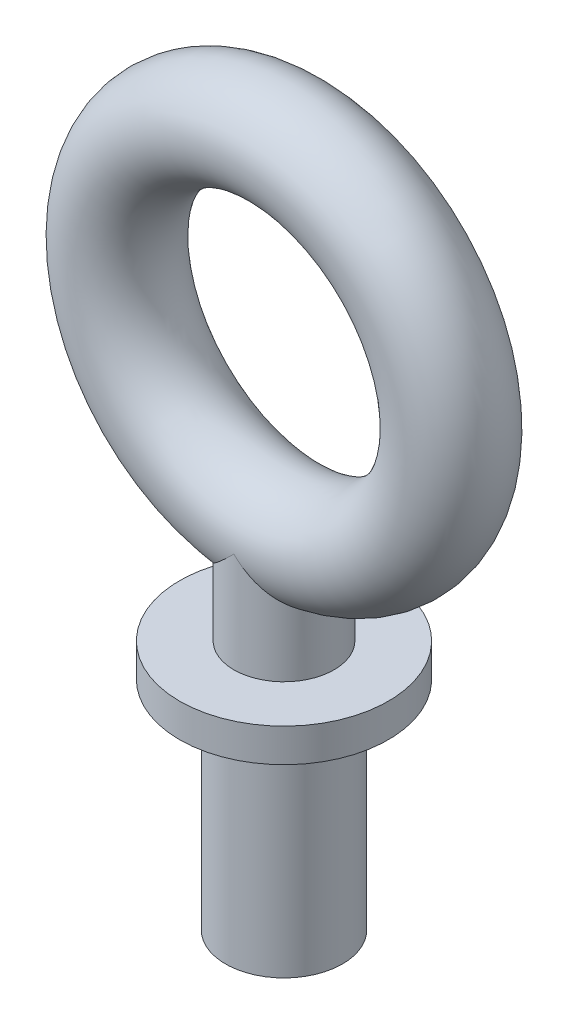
ISO-10303-21;
HEADER;
FILE_DESCRIPTION(('STEP AP214'),'2;1');
FILE_NAME('part.step','',(''),(''),'','','');
FILE_SCHEMA(('AUTOMOTIVE_DESIGN { 1 0 10303 214 1 1 1 1 }'));
ENDSEC;
DATA;
#1=APPLICATION_CONTEXT('core data for automotive mechanical design processes');
#2=APPLICATION_PROTOCOL_DEFINITION('international standard','automotive_design',2000,#1);
#3=PRODUCT_CONTEXT('',#1,'mechanical');
#4=PRODUCT('Part','Part','',(#3));
#5=PRODUCT_RELATED_PRODUCT_CATEGORY('part','',(#4));
#6=PRODUCT_DEFINITION_FORMATION('','',#4);
#7=PRODUCT_DEFINITION_CONTEXT('part definition',#1,'design');
#8=PRODUCT_DEFINITION('design','',#6,#7);
#9=PRODUCT_DEFINITION_SHAPE('','',#8);
#10=(LENGTH_UNIT() NAMED_UNIT(*) SI_UNIT(.MILLI.,.METRE.));
#11=(NAMED_UNIT(*) PLANE_ANGLE_UNIT() SI_UNIT($,.RADIAN.));
#12=(NAMED_UNIT(*) SI_UNIT($,.STERADIAN.) SOLID_ANGLE_UNIT());
#13=UNCERTAINTY_MEASURE_WITH_UNIT(LENGTH_MEASURE(1.E-05),#10,'distance_accuracy_value','');
#14=(GEOMETRIC_REPRESENTATION_CONTEXT(3) GLOBAL_UNCERTAINTY_ASSIGNED_CONTEXT((#13)) GLOBAL_UNIT_ASSIGNED_CONTEXT((#10,
#11,#12)) REPRESENTATION_CONTEXT('',''));
#15=CARTESIAN_POINT('',(0.,0.,0.));
#16=DIRECTION('',(0.,0.,1.));
#17=DIRECTION('',(1.,0.,0.));
#18=AXIS2_PLACEMENT_3D('',#15,#16,#17);
#19=CARTESIAN_POINT('',(0.,33.022,0.));
#20=DIRECTION('',(0.,-1.,0.));
#21=DIRECTION('',(0.,0.,-1.));
#22=AXIS2_PLACEMENT_3D('',#19,#20,#21);
#23=CYLINDRICAL_SURFACE('',#22,7.62);
#24=CARTESIAN_POINT('',(0.,-25.4,-7.62));
#25=CARTESIAN_POINT('',(0.00411493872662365,-25.4041149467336,-7.6200000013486));
#26=CARTESIAN_POINT('',(0.00823045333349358,-25.4082294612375,-7.6199966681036));
#27=CARTESIAN_POINT('',(0.46651280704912,-25.8662883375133,-7.6192539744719));
#28=CARTESIAN_POINT('',(0.927633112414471,-26.3149263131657,-7.57788714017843));
#29=CARTESIAN_POINT('',(1.62086951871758,-26.973112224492,-7.44933852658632));
#30=CARTESIAN_POINT('',(1.85250236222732,-27.190311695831,-7.39529502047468));
#31=CARTESIAN_POINT('',(2.31469432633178,-27.6186947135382,-7.26390249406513));
#32=CARTESIAN_POINT('',(2.54525367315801,-27.829879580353,-7.18655863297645));
#33=CARTESIAN_POINT('',(3.17743918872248,-28.4025850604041,-6.93941861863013));
#34=CARTESIAN_POINT('',(3.57622005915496,-28.7566801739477,-6.74398858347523));
#35=CARTESIAN_POINT('',(4.35136229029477,-29.4333736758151,-6.27181099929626));
#36=CARTESIAN_POINT('',(4.72775667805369,-29.7560189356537,-5.9951870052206));
#37=CARTESIAN_POINT('',(5.36625561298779,-30.2955884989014,-5.4231627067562));
#38=CARTESIAN_POINT('',(5.63579554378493,-30.5205083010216,-5.14380076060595));
#39=CARTESIAN_POINT('',(6.01270124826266,-30.8320624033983,-4.68519414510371));
#40=CARTESIAN_POINT('',(6.13376462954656,-30.9316058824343,-4.52573881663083));
#41=CARTESIAN_POINT('',(6.36526394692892,-31.1211241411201,-4.1938875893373));
#42=CARTESIAN_POINT('',(6.47570154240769,-31.2111004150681,-4.02149371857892));
#43=CARTESIAN_POINT('',(6.66713662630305,-31.3664718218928,-3.69372161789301));
#44=CARTESIAN_POINT('',(6.7499922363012,-31.4334784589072,-3.54018793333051));
#45=CARTESIAN_POINT('',(6.90608009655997,-31.5593540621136,-3.22511238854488));
#46=CARTESIAN_POINT('',(6.97931415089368,-31.6182245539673,-3.06357203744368));
#47=CARTESIAN_POINT('',(7.11516688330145,-31.7271720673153,-2.73325505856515));
#48=CARTESIAN_POINT('',(7.17778790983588,-31.7772510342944,-2.56448004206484));
#49=CARTESIAN_POINT('',(7.29150476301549,-31.8680169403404,-2.2206186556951));
#50=CARTESIAN_POINT('',(7.34260042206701,-31.9087037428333,-2.04553219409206));
#51=CARTESIAN_POINT('',(7.43267616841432,-31.9803258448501,-1.68927738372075));
#52=CARTESIAN_POINT('',(7.47159043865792,-32.0112081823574,-1.50808166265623));
#53=CARTESIAN_POINT('',(7.53625055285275,-32.062473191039,-1.141882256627));
#54=CARTESIAN_POINT('',(7.56199629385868,-32.0828557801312,-0.956878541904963));
#55=CARTESIAN_POINT('',(7.59983903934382,-32.1128019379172,-0.584662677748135));
#56=CARTESIAN_POINT('',(7.61194000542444,-32.122368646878,-0.397451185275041));
#57=CARTESIAN_POINT('',(7.62227520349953,-32.1305399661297,-0.0224142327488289));
#58=CARTESIAN_POINT('',(7.62051051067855,-32.1291454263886,0.165411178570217));
#59=CARTESIAN_POINT('',(7.60395034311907,-32.1160506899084,0.522836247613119));
#60=CARTESIAN_POINT('',(7.59036357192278,-32.1053064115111,0.692529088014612));
#61=CARTESIAN_POINT('',(7.55198907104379,-32.0749322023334,1.02989839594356));
#62=CARTESIAN_POINT('',(7.52719756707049,-32.0552992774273,1.19757416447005));
#63=CARTESIAN_POINT('',(7.46679991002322,-32.0074055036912,1.52962946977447));
#64=CARTESIAN_POINT('',(7.4311984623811,-31.9791484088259,1.69401040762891));
#65=CARTESIAN_POINT('',(7.34967696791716,-31.9143328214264,2.01857919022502));
#66=CARTESIAN_POINT('',(7.30375297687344,-31.877771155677,2.17876540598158));
#67=CARTESIAN_POINT('',(7.2015925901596,-31.7962668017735,2.49590611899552));
#68=CARTESIAN_POINT('',(7.14523735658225,-31.7512274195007,2.65279745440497));
#69=CARTESIAN_POINT('',(7.02331973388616,-31.6535468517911,2.96054290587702));
#70=CARTESIAN_POINT('',(6.95775407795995,-31.6009029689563,3.11139485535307));
#71=CARTESIAN_POINT('',(6.74840844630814,-31.4323363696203,3.5538227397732));
#72=CARTESIAN_POINT('',(6.59191338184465,-31.3057259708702,3.83547286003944));
#73=CARTESIAN_POINT('',(6.23052528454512,-31.0112063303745,4.4012884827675));
#74=CARTESIAN_POINT('',(6.02204158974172,-30.8401273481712,4.68146598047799));
#75=CARTESIAN_POINT('',(5.57877460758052,-30.4728641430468,5.20178569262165));
#76=CARTESIAN_POINT('',(5.3439730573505,-30.2766624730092,5.44189981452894));
#77=CARTESIAN_POINT('',(4.91654451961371,-29.9156226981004,5.82690955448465));
#78=CARTESIAN_POINT('',(4.72801064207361,-29.7551722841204,5.98061528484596));
#79=CARTESIAN_POINT('',(4.34280504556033,-29.4245106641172,6.26593127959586));
#80=CARTESIAN_POINT('',(4.1461301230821,-29.2542956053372,6.3975327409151));
#81=CARTESIAN_POINT('',(3.74660654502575,-28.905329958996,6.6394265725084));
#82=CARTESIAN_POINT('',(3.54374707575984,-28.7265640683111,6.74967880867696));
#83=CARTESIAN_POINT('',(3.13417403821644,-28.3621106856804,6.9493346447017));
#84=CARTESIAN_POINT('',(2.92746085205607,-28.1764238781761,7.03874029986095));
#85=CARTESIAN_POINT('',(2.27015731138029,-27.5798803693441,7.28987778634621));
#86=CARTESIAN_POINT('',(1.81521679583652,-27.1580305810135,7.41497793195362));
#87=CARTESIAN_POINT('',(0.908844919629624,-26.2966667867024,7.57959069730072));
#88=CARTESIAN_POINT('',(0.457408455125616,-25.8571887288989,7.61926929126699));
#89=CARTESIAN_POINT('',(0.00823047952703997,-25.4082294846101,7.61999666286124));
#90=CARTESIAN_POINT('',(0.00411496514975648,-25.4041149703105,7.61999999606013));
#91=CARTESIAN_POINT('',(0.,-25.4,7.62));
#92=B_SPLINE_CURVE_WITH_KNOTS('',3,(#24,#25,#26,#27,#28,#29,#30,#31,#32,#33,#34,#35,#36,#37,#38,
#39,#40,#41,#42,#43,#44,#45,#46,#47,#48,#49,#50,#51,#52,#53,#54,#55,#56,#57,#58,#59,#60,#61,#62,
#63,#64,#65,#66,#67,#68,#69,#70,#71,#72,#73,#74,#75,#76,#77,#78,#79,#80,#81,#82,#83,#84,#85,#86,
#87,#88,#89,#90,#91),.UNSPECIFIED.,.F.,.F.,(4,2,2,2,2,2,2,2,2,2,2,2,2,2,2,2,2,2,2,2,2,2,2,2,2,2,
2,2,2,2,2,2,2,4),(0.,0.0174585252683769,1.94382101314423,2.90945435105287,3.87487403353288,
5.57231356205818,7.26718332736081,8.60743588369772,9.2775061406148,9.94747158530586,
10.5075897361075,11.0676027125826,11.6274916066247,12.1873886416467,12.7502606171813,
13.3131369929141,13.8758499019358,14.4385191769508,14.9496362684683,15.4609256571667,
15.971992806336,16.4832555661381,17.0007480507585,17.5184245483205,18.5531267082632,
19.7156586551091,20.8790023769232,21.7521041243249,22.6255527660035,23.5006277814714,
24.3756164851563,26.2670529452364,28.1548110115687,28.1722695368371),.UNSPECIFIED.);
#93=CARTESIAN_POINT('',(0.,-25.4,-7.62));
#94=VERTEX_POINT('',#93);
#95=CARTESIAN_POINT('',(0.,-25.4,7.6200000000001));
#96=VERTEX_POINT('',#95);
#97=EDGE_CURVE('E43',#94,#96,#92,.T.);
#98=ORIENTED_EDGE('',*,*,#97,.T.);
#99=CARTESIAN_POINT('',(0.,-25.4,-7.62));
#100=CARTESIAN_POINT('',(-0.00411496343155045,-25.4041149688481,-7.61999999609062));
#101=CARTESIAN_POINT('',(-0.00823047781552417,-25.4082294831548,-7.61999666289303));
#102=CARTESIAN_POINT('',(-0.46627763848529,-25.866053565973,-7.61925492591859));
#103=CARTESIAN_POINT('',(-0.926860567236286,-26.31419808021,-7.5779934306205));
#104=CARTESIAN_POINT('',(-1.85178904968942,-27.1923510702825,-7.40655553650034));
#105=CARTESIAN_POINT('',(-2.31614147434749,-27.6223061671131,-7.27613443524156));
#106=CARTESIAN_POINT('',(-3.01700796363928,-28.2572575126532,-7.00213113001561));
#107=CARTESIAN_POINT('',(-3.25787124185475,-28.4728704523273,-6.89364825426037));
#108=CARTESIAN_POINT('',(-3.73375817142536,-28.8942764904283,-6.64794390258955));
#109=CARTESIAN_POINT('',(-3.96878039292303,-29.100067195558,-6.5107154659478));
#110=CARTESIAN_POINT('',(-4.42894602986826,-29.4989857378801,-6.2068232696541));
#111=CARTESIAN_POINT('',(-4.65411674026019,-29.6921494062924,-6.04024824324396));
#112=CARTESIAN_POINT('',(-5.09137268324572,-30.0638689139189,-5.67653612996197));
#113=CARTESIAN_POINT('',(-5.30346737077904,-30.2424353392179,-5.47942149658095));
#114=CARTESIAN_POINT('',(-5.63043569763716,-30.5155181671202,-5.13757295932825));
#115=CARTESIAN_POINT('',(-5.75087943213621,-30.6155840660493,-5.00252008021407));
#116=CARTESIAN_POINT('',(-5.98407326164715,-30.8084437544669,-4.72108446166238));
#117=CARTESIAN_POINT('',(-6.09682562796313,-30.9012396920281,-4.57470509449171));
#118=CARTESIAN_POINT('',(-6.31341842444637,-31.0787635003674,-4.27082725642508));
#119=CARTESIAN_POINT('',(-6.41725793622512,-31.1634905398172,-4.11332764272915));
#120=CARTESIAN_POINT('',(-6.61464707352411,-31.3239605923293,-3.78775151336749));
#121=CARTESIAN_POINT('',(-6.70820148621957,-31.3997077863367,-3.61967997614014));
#122=CARTESIAN_POINT('',(-6.88450581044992,-31.542003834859,-3.27204776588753));
#123=CARTESIAN_POINT('',(-6.9671512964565,-31.6084641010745,-3.09239757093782));
#124=CARTESIAN_POINT('',(-7.119223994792,-31.7304317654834,-2.72409889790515));
#125=CARTESIAN_POINT('',(-7.18865776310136,-31.7859445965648,-2.53545494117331));
#126=CARTESIAN_POINT('',(-7.31304025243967,-31.8851832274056,-2.15051930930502));
#127=CARTESIAN_POINT('',(-7.36799509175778,-31.9289140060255,-1.95423090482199));
#128=CARTESIAN_POINT('',(-7.4623306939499,-32.0038717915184,-1.55561768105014));
#129=CARTESIAN_POINT('',(-7.50171382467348,-32.0351006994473,-1.35329378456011));
#130=CARTESIAN_POINT('',(-7.5603027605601,-32.0815187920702,-0.969177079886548));
#131=CARTESIAN_POINT('',(-7.58136630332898,-32.0981858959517,-0.787843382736));
#132=CARTESIAN_POINT('',(-7.6104171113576,-32.1211662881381,-0.423485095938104));
#133=CARTESIAN_POINT('',(-7.61840560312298,-32.1274805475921,-0.240460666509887));
#134=CARTESIAN_POINT('',(-7.62116219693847,-32.129659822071,0.125685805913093));
#135=CARTESIAN_POINT('',(-7.61593473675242,-32.1255283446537,0.308807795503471));
#136=CARTESIAN_POINT('',(-7.5923636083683,-32.1068864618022,0.673669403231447));
#137=CARTESIAN_POINT('',(-7.57402033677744,-32.0923763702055,0.855409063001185));
#138=CARTESIAN_POINT('',(-7.52648273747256,-32.054728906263,1.20192109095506));
#139=CARTESIAN_POINT('',(-7.49824806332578,-32.0323540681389,1.36690981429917));
#140=CARTESIAN_POINT('',(-7.43131686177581,-31.9792370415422,1.69343185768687));
#141=CARTESIAN_POINT('',(-7.39261705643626,-31.9484922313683,1.85496407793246));
#142=CARTESIAN_POINT('',(-7.30531238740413,-31.8790067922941,2.17349345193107));
#143=CARTESIAN_POINT('',(-7.25671115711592,-31.8402690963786,2.33049224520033));
#144=CARTESIAN_POINT('',(-7.15020910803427,-31.7551953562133,2.639240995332));
#145=CARTESIAN_POINT('',(-7.09230484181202,-31.7088564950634,2.79098898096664));
#146=CARTESIAN_POINT('',(-6.96463491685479,-31.6064266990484,3.09629519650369));
#147=CARTESIAN_POINT('',(-6.89440661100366,-31.549951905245,3.24953137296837));
#148=CARTESIAN_POINT('',(-6.74527550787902,-31.4296614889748,3.54875309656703));
#149=CARTESIAN_POINT('',(-6.66636927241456,-31.3658429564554,3.69473573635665));
#150=CARTESIAN_POINT('',(-6.41789029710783,-31.164191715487,4.12105677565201));
#151=CARTESIAN_POINT('',(-6.23650689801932,-31.0161231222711,4.38988659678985));
#152=CARTESIAN_POINT('',(-5.90629183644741,-30.7443053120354,4.81981581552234));
#153=CARTESIAN_POINT('',(-5.76354834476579,-30.6261879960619,4.98936473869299));
#154=CARTESIAN_POINT('',(-5.46792329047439,-30.3800208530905,5.3116859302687));
#155=CARTESIAN_POINT('',(-5.31503856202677,-30.2519679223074,5.4644529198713));
#156=CARTESIAN_POINT('',(-4.8437359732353,-29.8545121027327,5.89787960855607));
#157=CARTESIAN_POINT('',(-4.51295008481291,-29.5720416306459,6.15331003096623));
#158=CARTESIAN_POINT('',(-3.72825762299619,-28.8912330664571,6.66681011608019));
#159=CARTESIAN_POINT('',(-3.2674667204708,-28.4837577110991,6.9021262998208));
#160=CARTESIAN_POINT('',(-2.56785201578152,-27.8505290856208,7.17868663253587));
#161=CARTESIAN_POINT('',(-2.33314355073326,-27.6356901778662,7.25815479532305));
#162=CARTESIAN_POINT('',(-1.86260346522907,-27.1997718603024,7.39289660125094));
#163=CARTESIAN_POINT('',(-1.62677225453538,-26.9786946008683,7.44817847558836));
#164=CARTESIAN_POINT('',(-1.15984917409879,-26.5354226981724,7.53489054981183));
#165=CARTESIAN_POINT('',(-0.928746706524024,-26.3133156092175,7.56672195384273));
#166=CARTESIAN_POINT('',(-0.468682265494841,-25.8654040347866,7.60907431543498));
#167=CARTESIAN_POINT('',(-0.239717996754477,-25.6396044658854,7.61962160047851));
#168=CARTESIAN_POINT('',(-0.00823050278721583,-25.4082295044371,7.61999666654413));
#169=CARTESIAN_POINT('',(-0.00411498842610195,-25.4041149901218,7.6199999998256));
#170=CARTESIAN_POINT('',(0.,-25.4,7.62));
#171=B_SPLINE_CURVE_WITH_KNOTS('',3,(#99,#100,#101,#102,#103,#104,#105,#106,#107,#108,#109,#110,
#111,#112,#113,#114,#115,#116,#117,#118,#119,#120,#121,#122,#123,#124,#125,#126,#127,#128,#129,
#130,#131,#132,#133,#134,#135,#136,#137,#138,#139,#140,#141,#142,#143,#144,#145,#146,#147,#148,
#149,#150,#151,#152,#153,#154,#155,#156,#157,#158,#159,#160,#161,#162,#163,#164,#165,#166,#167,
#168,#169,#170),.UNSPECIFIED.,.F.,.F.,(4,2,2,2,2,2,2,2,2,2,2,2,2,2,2,2,2,2,2,2,2,2,2,2,2,2,2,2,
2,2,2,2,2,2,2,4),(0.,0.0174585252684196,1.94283499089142,3.8735170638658,4.89530644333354,
5.91734353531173,6.93634180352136,7.95459440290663,8.57444213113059,9.19410601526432,
9.81383367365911,10.4332716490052,11.0582650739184,11.6829475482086,12.3073656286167,
12.931688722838,13.48088465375,14.0300290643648,14.5789891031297,15.1279325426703,
15.6339915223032,16.1402091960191,16.646241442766,17.1524616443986,17.6852166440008,
18.2181834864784,19.2837168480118,20.0362664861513,20.7890521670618,22.2961253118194,
24.2608543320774,25.2440326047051,26.2268760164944,27.1924869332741,28.1569026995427,
28.1743612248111),.UNSPECIFIED.);
#172=EDGE_CURVE('E51',#96,#94,#171,.F.);
#173=ORIENTED_EDGE('',*,*,#172,.T.);
#174=EDGE_LOOP('',(#98,#173));
#175=FACE_BOUND('',#174,.T.);
#176=CARTESIAN_POINT('',(0.,-40.64,0.));
#177=DIRECTION('',(0.,1.,0.));
#178=DIRECTION('',(0.,0.,1.));
#179=AXIS2_PLACEMENT_3D('',#176,#177,#178);
#180=CIRCLE('',#179,7.62);
#181=CARTESIAN_POINT('',(0.,-40.64,7.62));
#182=VERTEX_POINT('',#181);
#183=EDGE_CURVE('E38',#182,#182,#180,.T.);
#184=ORIENTED_EDGE('',*,*,#183,.T.);
#185=EDGE_LOOP('',(#184));
#186=FACE_BOUND('',#185,.T.);
#187=ADVANCED_FACE('F34',(#175,#186),#23,.T.);
#188=CARTESIAN_POINT('',(0.,0.,0.));
#189=DIRECTION('',(0.,0.,1.));
#190=DIRECTION('',(1.,0.,0.));
#191=AXIS2_PLACEMENT_3D('',#188,#189,#190);
#192=TOROIDAL_SURFACE('',#191,25.4,7.62);
#193=ORIENTED_EDGE('',*,*,#172,.F.);
#194=ORIENTED_EDGE('',*,*,#97,.F.);
#195=EDGE_LOOP('',(#193,#194));
#196=FACE_BOUND('',#195,.T.);
#197=ADVANCED_FACE('F36',(#196),#192,.T.);
#198=CARTESIAN_POINT('',(0.,-45.72,0.));
#199=DIRECTION('',(0.,1.,0.));
#200=DIRECTION('',(0.,0.,1.));
#201=AXIS2_PLACEMENT_3D('',#198,#199,#200);
#202=CYLINDRICAL_SURFACE('',#201,15.875);
#203=CARTESIAN_POINT('',(0.,-45.72,0.));
#204=DIRECTION('',(0.,-1.,0.));
#205=DIRECTION('',(0.,0.,-1.));
#206=AXIS2_PLACEMENT_3D('',#203,#204,#205);
#207=CIRCLE('',#206,15.875);
#208=CARTESIAN_POINT('',(0.,-45.72,-15.875));
#209=VERTEX_POINT('',#208);
#210=EDGE_CURVE('E138',#209,#209,#207,.T.);
#211=ORIENTED_EDGE('',*,*,#210,.F.);
#212=EDGE_LOOP('',(#211));
#213=FACE_BOUND('',#212,.T.);
#214=CARTESIAN_POINT('',(0.,-40.64,0.));
#215=DIRECTION('',(0.,-1.,0.));
#216=DIRECTION('',(0.,0.,-1.));
#217=AXIS2_PLACEMENT_3D('',#214,#215,#216);
#218=CIRCLE('',#217,15.875);
#219=CARTESIAN_POINT('',(0.,-40.64,-15.875));
#220=VERTEX_POINT('',#219);
#221=EDGE_CURVE('E135',#220,#220,#218,.T.);
#222=ORIENTED_EDGE('',*,*,#221,.T.);
#223=EDGE_LOOP('',(#222));
#224=FACE_BOUND('',#223,.T.);
#225=ADVANCED_FACE('F68',(#213,#224),#202,.T.);
#226=CARTESIAN_POINT('',(0.,-45.72,0.));
#227=DIRECTION('',(0.,-1.,0.));
#228=DIRECTION('',(0.,0.,-1.));
#229=AXIS2_PLACEMENT_3D('',#226,#227,#228);
#230=PLANE('',#229);
#231=CARTESIAN_POINT('',(0.,-45.72,0.));
#232=DIRECTION('',(0.,-1.,0.));
#233=DIRECTION('',(0.,0.,-1.));
#234=AXIS2_PLACEMENT_3D('',#231,#232,#233);
#235=CIRCLE('',#234,8.89);
#236=CARTESIAN_POINT('',(0.,-45.72,-8.89));
#237=VERTEX_POINT('',#236);
#238=EDGE_CURVE('E11',#237,#237,#235,.T.);
#239=ORIENTED_EDGE('',*,*,#238,.F.);
#240=EDGE_LOOP('',(#239));
#241=FACE_BOUND('',#240,.T.);
#242=ORIENTED_EDGE('',*,*,#210,.T.);
#243=EDGE_LOOP('',(#242));
#244=FACE_BOUND('',#243,.T.);
#245=ADVANCED_FACE('F72',(#241,#244),#230,.T.);
#246=CARTESIAN_POINT('',(0.,-40.64,0.));
#247=DIRECTION('',(0.,-1.,0.));
#248=DIRECTION('',(0.,0.,-1.));
#249=AXIS2_PLACEMENT_3D('',#246,#247,#248);
#250=PLANE('',#249);
#251=ORIENTED_EDGE('',*,*,#183,.F.);
#252=EDGE_LOOP('',(#251));
#253=FACE_BOUND('',#252,.T.);
#254=ORIENTED_EDGE('',*,*,#221,.F.);
#255=EDGE_LOOP('',(#254));
#256=FACE_BOUND('',#255,.T.);
#257=ADVANCED_FACE('F74',(#253,#256),#250,.F.);
#258=CARTESIAN_POINT('',(0.,-78.74,0.));
#259=DIRECTION('',(0.,1.,0.));
#260=DIRECTION('',(0.,0.,1.));
#261=AXIS2_PLACEMENT_3D('',#258,#259,#260);
#262=CYLINDRICAL_SURFACE('',#261,8.89);
#263=CARTESIAN_POINT('',(0.,-78.74,0.));
#264=DIRECTION('',(0.,-1.,0.));
#265=DIRECTION('',(0.,0.,-1.));
#266=AXIS2_PLACEMENT_3D('',#263,#264,#265);
#267=CIRCLE('',#266,8.89);
#268=CARTESIAN_POINT('',(0.,-78.74,-8.89));
#269=VERTEX_POINT('',#268);
#270=EDGE_CURVE('E134',#269,#269,#267,.T.);
#271=ORIENTED_EDGE('',*,*,#270,.F.);
#272=EDGE_LOOP('',(#271));
#273=FACE_BOUND('',#272,.T.);
#274=ORIENTED_EDGE('',*,*,#238,.T.);
#275=EDGE_LOOP('',(#274));
#276=FACE_BOUND('',#275,.T.);
#277=ADVANCED_FACE('F77',(#273,#276),#262,.T.);
#278=CARTESIAN_POINT('',(0.,-78.74,0.));
#279=DIRECTION('',(0.,-1.,0.));
#280=DIRECTION('',(0.,0.,-1.));
#281=AXIS2_PLACEMENT_3D('',#278,#279,#280);
#282=PLANE('',#281);
#283=ORIENTED_EDGE('',*,*,#270,.T.);
#284=EDGE_LOOP('',(#283));
#285=FACE_BOUND('',#284,.T.);
#286=ADVANCED_FACE('F84',(#285),#282,.T.);
#287=CLOSED_SHELL('',(#187,#197,#225,#245,#257,#277,#286));
#288=MANIFOLD_SOLID_BREP('B2',#287);
#289=ADVANCED_BREP_SHAPE_REPRESENTATION('',(#18,#288),#14);
#290=SHAPE_DEFINITION_REPRESENTATION(#9,#289);
ENDSEC;
END-ISO-10303-21;
